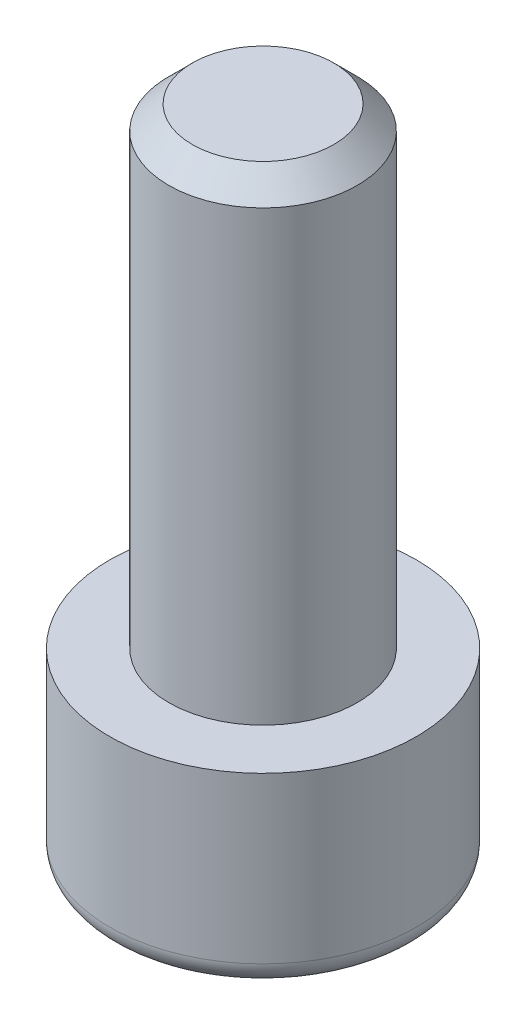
from build123d import *

# Parameters (mm, degrees)
ESQUISSE1_R             = 4
EXTRUSION1_DEPTH        = 20
CHANFREIN1_SIZE         = 1
ESQUISSE2_R             = 6.5
EXTRUSION2_DEPTH        = 8
CONG_1_R                = 1
ENL_V_MAT_EXTRU_1_DEPTH = 6


with BuildPart() as part:
    # Esquisse1 → Extrusion1 (new body)
    with BuildSketch(Plane(origin=(0, 0, 0), x_dir=(1, 0, 0), z_dir=(0, 1, 0))):
        with Locations(Location((0, 0, 0), (0, 0, 270))):
            Circle(ESQUISSE1_R)
    extrude(amount=EXTRUSION1_DEPTH)

    # Chanfrein1
    chanfrein1_edges = [part.edges().sort_by_distance(p)[0] for p in [
        (0, 20, -4),
    ]]
    chamfer(chanfrein1_edges, length=CHANFREIN1_SIZE)

    # Esquisse2 → Extrusion2 (add)
    with BuildSketch(Plane.XZ):
        with Locations(Location((0, 0, 0), (0, 0, 270))):
            Circle(ESQUISSE2_R)
    extrude(amount=EXTRUSION2_DEPTH)

    # Cong_1
    cong_1_edges = [part.edges().sort_by_distance(p)[0] for p in [
        (0, -8, 6.5),
    ]]
    fillet(cong_1_edges, radius=CONG_1_R)

    # Esquisse3 → Enl_v. mat.-Extru.1 (cut)
    with BuildSketch(Plane.XZ.offset(8)):
        Polygon((-3, 1.72923601), (0, 3.45), (3, 1.72923601), (3, -1.72923601), (0, -3.45), (-3, -1.72923601), align=None)
    extrude(amount=-ENL_V_MAT_EXTRU_1_DEPTH, mode=Mode.SUBTRACT)


solid = part.part
